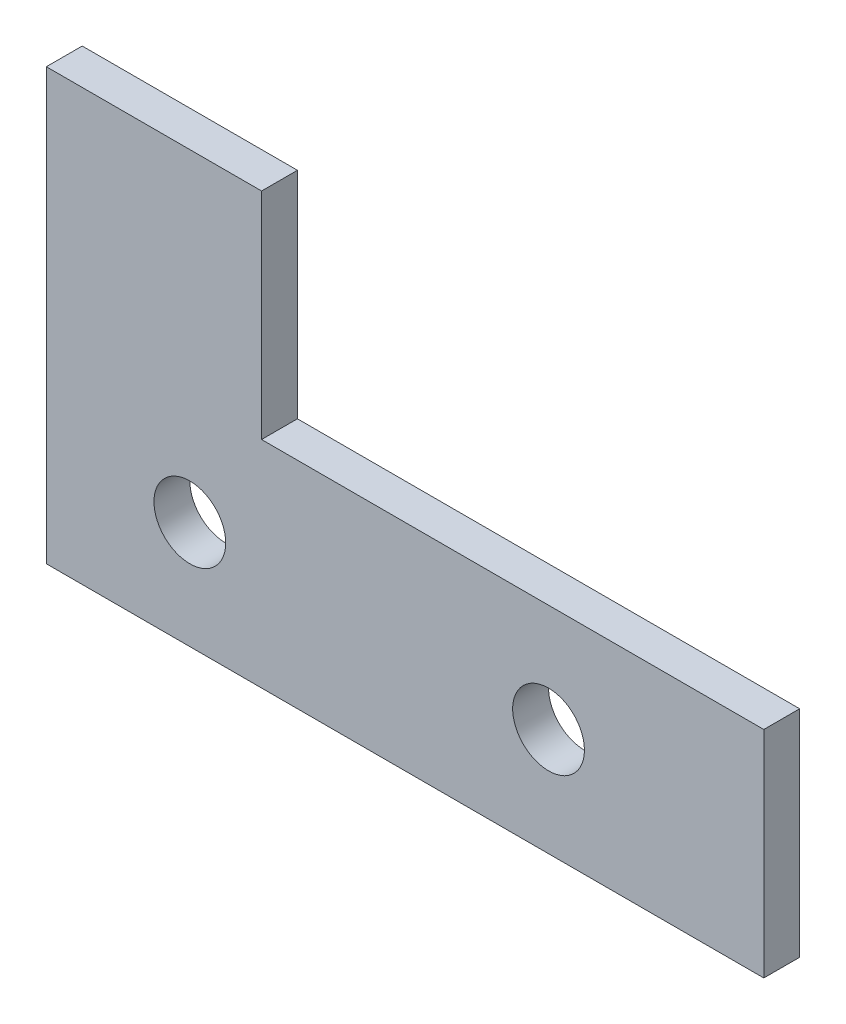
ISO-10303-21;
HEADER;
FILE_DESCRIPTION(('STEP AP214'),'2;1');
FILE_NAME('part.step','',(''),(''),'','','');
FILE_SCHEMA(('AUTOMOTIVE_DESIGN { 1 0 10303 214 1 1 1 1 }'));
ENDSEC;
DATA;
#1=APPLICATION_CONTEXT('core data for automotive mechanical design processes');
#2=APPLICATION_PROTOCOL_DEFINITION('international standard','automotive_design',2000,#1);
#3=PRODUCT_CONTEXT('',#1,'mechanical');
#4=PRODUCT('Part','Part','',(#3));
#5=PRODUCT_RELATED_PRODUCT_CATEGORY('part','',(#4));
#6=PRODUCT_DEFINITION_FORMATION('','',#4);
#7=PRODUCT_DEFINITION_CONTEXT('part definition',#1,'design');
#8=PRODUCT_DEFINITION('design','',#6,#7);
#9=PRODUCT_DEFINITION_SHAPE('','',#8);
#10=(LENGTH_UNIT() NAMED_UNIT(*) SI_UNIT(.MILLI.,.METRE.));
#11=(NAMED_UNIT(*) PLANE_ANGLE_UNIT() SI_UNIT($,.RADIAN.));
#12=(NAMED_UNIT(*) SI_UNIT($,.STERADIAN.) SOLID_ANGLE_UNIT());
#13=UNCERTAINTY_MEASURE_WITH_UNIT(LENGTH_MEASURE(1.E-05),#10,'distance_accuracy_value','');
#14=(GEOMETRIC_REPRESENTATION_CONTEXT(3) GLOBAL_UNCERTAINTY_ASSIGNED_CONTEXT((#13)) GLOBAL_UNIT_ASSIGNED_CONTEXT((#10,
#11,#12)) REPRESENTATION_CONTEXT('',''));
#15=CARTESIAN_POINT('',(0.,0.,0.));
#16=DIRECTION('',(0.,0.,1.));
#17=DIRECTION('',(1.,0.,0.));
#18=AXIS2_PLACEMENT_3D('',#15,#16,#17);
#19=CARTESIAN_POINT('',(0.,76.2,6.35));
#20=DIRECTION('',(0.,0.,-1.));
#21=DIRECTION('',(-1.,0.,0.));
#22=AXIS2_PLACEMENT_3D('',#19,#20,#21);
#23=PLANE('',#22);
#24=CARTESIAN_POINT('',(25.4,19.05,6.35));
#25=DIRECTION('',(0.,0.,1.));
#26=DIRECTION('',(1.,0.,0.));
#27=AXIS2_PLACEMENT_3D('',#24,#25,#26);
#28=CIRCLE('',#27,6.35);
#29=CARTESIAN_POINT('',(31.75,19.05,6.35));
#30=VERTEX_POINT('',#29);
#31=EDGE_CURVE('E121',#30,#30,#28,.T.);
#32=ORIENTED_EDGE('',*,*,#31,.F.);
#33=EDGE_LOOP('',(#32));
#34=FACE_BOUND('',#33,.T.);
#35=DIRECTION('',(0.,-1.,0.));
#36=VECTOR('',#35,1.);
#37=CARTESIAN_POINT('',(0.,0.,6.35));
#38=LINE('',#37,#36);
#39=CARTESIAN_POINT('',(0.,76.2,6.35));
#40=VERTEX_POINT('',#39);
#41=CARTESIAN_POINT('',(0.,0.,6.35));
#42=VERTEX_POINT('',#41);
#43=EDGE_CURVE('E128',#40,#42,#38,.T.);
#44=ORIENTED_EDGE('',*,*,#43,.T.);
#45=DIRECTION('',(1.,0.,0.));
#46=VECTOR('',#45,1.);
#47=CARTESIAN_POINT('',(0.,0.,6.35));
#48=LINE('',#47,#46);
#49=CARTESIAN_POINT('',(127.,0.,6.35));
#50=VERTEX_POINT('',#49);
#51=EDGE_CURVE('E86',#42,#50,#48,.T.);
#52=ORIENTED_EDGE('',*,*,#51,.T.);
#53=DIRECTION('',(0.,1.,0.));
#54=VECTOR('',#53,1.);
#55=CARTESIAN_POINT('',(127.,0.,6.35));
#56=LINE('',#55,#54);
#57=CARTESIAN_POINT('',(127.,38.1,6.35));
#58=VERTEX_POINT('',#57);
#59=EDGE_CURVE('E99',#50,#58,#56,.T.);
#60=ORIENTED_EDGE('',*,*,#59,.T.);
#61=DIRECTION('',(-1.,0.,0.));
#62=VECTOR('',#61,1.);
#63=CARTESIAN_POINT('',(38.1,38.1,6.35));
#64=LINE('',#63,#62);
#65=CARTESIAN_POINT('',(38.1,38.1,6.35));
#66=VERTEX_POINT('',#65);
#67=EDGE_CURVE('E93',#58,#66,#64,.T.);
#68=ORIENTED_EDGE('',*,*,#67,.T.);
#69=DIRECTION('',(0.,1.,0.));
#70=VECTOR('',#69,1.);
#71=CARTESIAN_POINT('',(38.1,38.1,6.35));
#72=LINE('',#71,#70);
#73=CARTESIAN_POINT('',(38.1,76.2,6.35));
#74=VERTEX_POINT('',#73);
#75=EDGE_CURVE('E97',#66,#74,#72,.T.);
#76=ORIENTED_EDGE('',*,*,#75,.T.);
#77=DIRECTION('',(-1.,0.,0.));
#78=VECTOR('',#77,1.);
#79=CARTESIAN_POINT('',(0.,76.2,6.35));
#80=LINE('',#79,#78);
#81=EDGE_CURVE('E49',#74,#40,#80,.T.);
#82=ORIENTED_EDGE('',*,*,#81,.T.);
#83=EDGE_LOOP('',(#44,#52,#60,#68,#76,#82));
#84=FACE_BOUND('',#83,.T.);
#85=CARTESIAN_POINT('',(88.9,19.05,6.35));
#86=DIRECTION('',(0.,0.,1.));
#87=DIRECTION('',(1.,0.,0.));
#88=AXIS2_PLACEMENT_3D('',#85,#86,#87);
#89=CIRCLE('',#88,6.35);
#90=CARTESIAN_POINT('',(95.25,19.05,6.35));
#91=VERTEX_POINT('',#90);
#92=EDGE_CURVE('E171',#91,#91,#89,.T.);
#93=ORIENTED_EDGE('',*,*,#92,.F.);
#94=EDGE_LOOP('',(#93));
#95=FACE_BOUND('',#94,.T.);
#96=ADVANCED_FACE('F32',(#34,#84,#95),#23,.F.);
#97=CARTESIAN_POINT('',(0.,76.2,0.));
#98=DIRECTION('',(0.,0.,-1.));
#99=DIRECTION('',(-1.,0.,0.));
#100=AXIS2_PLACEMENT_3D('',#97,#98,#99);
#101=PLANE('',#100);
#102=CARTESIAN_POINT('',(25.4,19.05,0.));
#103=DIRECTION('',(0.,0.,1.));
#104=DIRECTION('',(1.,0.,0.));
#105=AXIS2_PLACEMENT_3D('',#102,#103,#104);
#106=CIRCLE('',#105,6.35);
#107=CARTESIAN_POINT('',(31.75,19.05,0.));
#108=VERTEX_POINT('',#107);
#109=EDGE_CURVE('E176',#108,#108,#106,.T.);
#110=ORIENTED_EDGE('',*,*,#109,.T.);
#111=EDGE_LOOP('',(#110));
#112=FACE_BOUND('',#111,.T.);
#113=DIRECTION('',(0.,-1.,0.));
#114=VECTOR('',#113,1.);
#115=CARTESIAN_POINT('',(0.,0.,0.));
#116=LINE('',#115,#114);
#117=CARTESIAN_POINT('',(0.,76.2,0.));
#118=VERTEX_POINT('',#117);
#119=CARTESIAN_POINT('',(0.,0.,0.));
#120=VERTEX_POINT('',#119);
#121=EDGE_CURVE('E117',#118,#120,#116,.T.);
#122=ORIENTED_EDGE('',*,*,#121,.F.);
#123=DIRECTION('',(-1.,0.,0.));
#124=VECTOR('',#123,1.);
#125=CARTESIAN_POINT('',(0.,76.2,0.));
#126=LINE('',#125,#124);
#127=CARTESIAN_POINT('',(38.1,76.2,0.));
#128=VERTEX_POINT('',#127);
#129=EDGE_CURVE('E78',#128,#118,#126,.T.);
#130=ORIENTED_EDGE('',*,*,#129,.F.);
#131=DIRECTION('',(0.,1.,0.));
#132=VECTOR('',#131,1.);
#133=CARTESIAN_POINT('',(38.1,38.1,0.));
#134=LINE('',#133,#132);
#135=CARTESIAN_POINT('',(38.1,38.1,0.));
#136=VERTEX_POINT('',#135);
#137=EDGE_CURVE('E72',#136,#128,#134,.T.);
#138=ORIENTED_EDGE('',*,*,#137,.F.);
#139=DIRECTION('',(-1.,0.,0.));
#140=VECTOR('',#139,1.);
#141=CARTESIAN_POINT('',(38.1,38.1,0.));
#142=LINE('',#141,#140);
#143=CARTESIAN_POINT('',(127.,38.1,0.));
#144=VERTEX_POINT('',#143);
#145=EDGE_CURVE('E107',#144,#136,#142,.T.);
#146=ORIENTED_EDGE('',*,*,#145,.F.);
#147=DIRECTION('',(0.,1.,0.));
#148=VECTOR('',#147,1.);
#149=CARTESIAN_POINT('',(127.,0.,0.));
#150=LINE('',#149,#148);
#151=CARTESIAN_POINT('',(127.,0.,0.));
#152=VERTEX_POINT('',#151);
#153=EDGE_CURVE('E123',#152,#144,#150,.T.);
#154=ORIENTED_EDGE('',*,*,#153,.F.);
#155=DIRECTION('',(1.,0.,0.));
#156=VECTOR('',#155,1.);
#157=CARTESIAN_POINT('',(0.,0.,0.));
#158=LINE('',#157,#156);
#159=EDGE_CURVE('E120',#120,#152,#158,.T.);
#160=ORIENTED_EDGE('',*,*,#159,.F.);
#161=EDGE_LOOP('',(#122,#130,#138,#146,#154,#160));
#162=FACE_BOUND('',#161,.T.);
#163=CARTESIAN_POINT('',(88.9,19.05,0.));
#164=DIRECTION('',(0.,0.,1.));
#165=DIRECTION('',(1.,0.,0.));
#166=AXIS2_PLACEMENT_3D('',#163,#164,#165);
#167=CIRCLE('',#166,6.35);
#168=CARTESIAN_POINT('',(95.25,19.05,0.));
#169=VERTEX_POINT('',#168);
#170=EDGE_CURVE('E174',#169,#169,#167,.T.);
#171=ORIENTED_EDGE('',*,*,#170,.T.);
#172=EDGE_LOOP('',(#171));
#173=FACE_BOUND('',#172,.T.);
#174=ADVANCED_FACE('F137',(#112,#162,#173),#101,.T.);
#175=CARTESIAN_POINT('',(0.,0.,6.35));
#176=DIRECTION('',(1.,0.,0.));
#177=DIRECTION('',(0.,0.,-1.));
#178=AXIS2_PLACEMENT_3D('',#175,#176,#177);
#179=PLANE('',#178);
#180=ORIENTED_EDGE('',*,*,#121,.T.);
#181=DIRECTION('',(0.,0.,-1.));
#182=VECTOR('',#181,1.);
#183=CARTESIAN_POINT('',(0.,0.,6.35));
#184=LINE('',#183,#182);
#185=EDGE_CURVE('E11',#42,#120,#184,.T.);
#186=ORIENTED_EDGE('',*,*,#185,.F.);
#187=ORIENTED_EDGE('',*,*,#43,.F.);
#188=DIRECTION('',(0.,0.,-1.));
#189=VECTOR('',#188,1.);
#190=CARTESIAN_POINT('',(0.,76.2,6.35));
#191=LINE('',#190,#189);
#192=EDGE_CURVE('E113',#40,#118,#191,.T.);
#193=ORIENTED_EDGE('',*,*,#192,.T.);
#194=EDGE_LOOP('',(#180,#186,#187,#193));
#195=FACE_BOUND('',#194,.T.);
#196=ADVANCED_FACE('F34',(#195),#179,.F.);
#197=CARTESIAN_POINT('',(0.,0.,6.35));
#198=DIRECTION('',(0.,1.,0.));
#199=DIRECTION('',(0.,0.,1.));
#200=AXIS2_PLACEMENT_3D('',#197,#198,#199);
#201=PLANE('',#200);
#202=ORIENTED_EDGE('',*,*,#159,.T.);
#203=DIRECTION('',(0.,0.,-1.));
#204=VECTOR('',#203,1.);
#205=CARTESIAN_POINT('',(127.,0.,6.35));
#206=LINE('',#205,#204);
#207=EDGE_CURVE('E41',#50,#152,#206,.T.);
#208=ORIENTED_EDGE('',*,*,#207,.F.);
#209=ORIENTED_EDGE('',*,*,#51,.F.);
#210=ORIENTED_EDGE('',*,*,#185,.T.);
#211=EDGE_LOOP('',(#202,#208,#209,#210));
#212=FACE_BOUND('',#211,.T.);
#213=ADVANCED_FACE('F217',(#212),#201,.F.);
#214=CARTESIAN_POINT('',(127.,0.,6.35));
#215=DIRECTION('',(-1.,0.,0.));
#216=DIRECTION('',(0.,0.,1.));
#217=AXIS2_PLACEMENT_3D('',#214,#215,#216);
#218=PLANE('',#217);
#219=ORIENTED_EDGE('',*,*,#153,.T.);
#220=DIRECTION('',(0.,0.,-1.));
#221=VECTOR('',#220,1.);
#222=CARTESIAN_POINT('',(127.,38.1,6.35));
#223=LINE('',#222,#221);
#224=EDGE_CURVE('E108',#58,#144,#223,.T.);
#225=ORIENTED_EDGE('',*,*,#224,.F.);
#226=ORIENTED_EDGE('',*,*,#59,.F.);
#227=ORIENTED_EDGE('',*,*,#207,.T.);
#228=EDGE_LOOP('',(#219,#225,#226,#227));
#229=FACE_BOUND('',#228,.T.);
#230=ADVANCED_FACE('F134',(#229),#218,.F.);
#231=CARTESIAN_POINT('',(38.1,38.1,6.35));
#232=DIRECTION('',(0.,-1.,0.));
#233=DIRECTION('',(0.,0.,-1.));
#234=AXIS2_PLACEMENT_3D('',#231,#232,#233);
#235=PLANE('',#234);
#236=ORIENTED_EDGE('',*,*,#145,.T.);
#237=DIRECTION('',(0.,0.,-1.));
#238=VECTOR('',#237,1.);
#239=CARTESIAN_POINT('',(38.1,38.1,6.35));
#240=LINE('',#239,#238);
#241=EDGE_CURVE('E104',#66,#136,#240,.T.);
#242=ORIENTED_EDGE('',*,*,#241,.F.);
#243=ORIENTED_EDGE('',*,*,#67,.F.);
#244=ORIENTED_EDGE('',*,*,#224,.T.);
#245=EDGE_LOOP('',(#236,#242,#243,#244));
#246=FACE_BOUND('',#245,.T.);
#247=ADVANCED_FACE('F105',(#246),#235,.F.);
#248=CARTESIAN_POINT('',(38.1,38.1,6.35));
#249=DIRECTION('',(-1.,0.,0.));
#250=DIRECTION('',(0.,0.,1.));
#251=AXIS2_PLACEMENT_3D('',#248,#249,#250);
#252=PLANE('',#251);
#253=ORIENTED_EDGE('',*,*,#137,.T.);
#254=DIRECTION('',(0.,0.,-1.));
#255=VECTOR('',#254,1.);
#256=CARTESIAN_POINT('',(38.1,76.2,6.35));
#257=LINE('',#256,#255);
#258=EDGE_CURVE('E109',#74,#128,#257,.T.);
#259=ORIENTED_EDGE('',*,*,#258,.F.);
#260=ORIENTED_EDGE('',*,*,#75,.F.);
#261=ORIENTED_EDGE('',*,*,#241,.T.);
#262=EDGE_LOOP('',(#253,#259,#260,#261));
#263=FACE_BOUND('',#262,.T.);
#264=ADVANCED_FACE('F111',(#263),#252,.F.);
#265=CARTESIAN_POINT('',(0.,76.2,6.35));
#266=DIRECTION('',(0.,-1.,0.));
#267=DIRECTION('',(0.,0.,-1.));
#268=AXIS2_PLACEMENT_3D('',#265,#266,#267);
#269=PLANE('',#268);
#270=ORIENTED_EDGE('',*,*,#129,.T.);
#271=ORIENTED_EDGE('',*,*,#192,.F.);
#272=ORIENTED_EDGE('',*,*,#81,.F.);
#273=ORIENTED_EDGE('',*,*,#258,.T.);
#274=EDGE_LOOP('',(#270,#271,#272,#273));
#275=FACE_BOUND('',#274,.T.);
#276=ADVANCED_FACE('F142',(#275),#269,.F.);
#277=CARTESIAN_POINT('',(25.4,19.05,6.35));
#278=DIRECTION('',(0.,0.,-1.));
#279=DIRECTION('',(-1.,0.,0.));
#280=AXIS2_PLACEMENT_3D('',#277,#278,#279);
#281=CYLINDRICAL_SURFACE('',#280,6.35);
#282=ORIENTED_EDGE('',*,*,#31,.T.);
#283=EDGE_LOOP('',(#282));
#284=FACE_BOUND('',#283,.T.);
#285=ORIENTED_EDGE('',*,*,#109,.F.);
#286=EDGE_LOOP('',(#285));
#287=FACE_BOUND('',#286,.T.);
#288=ADVANCED_FACE('F144',(#284,#287),#281,.F.);
#289=CARTESIAN_POINT('',(88.9,19.05,6.35));
#290=DIRECTION('',(0.,0.,-1.));
#291=DIRECTION('',(-1.,0.,0.));
#292=AXIS2_PLACEMENT_3D('',#289,#290,#291);
#293=CYLINDRICAL_SURFACE('',#292,6.35);
#294=ORIENTED_EDGE('',*,*,#92,.T.);
#295=EDGE_LOOP('',(#294));
#296=FACE_BOUND('',#295,.T.);
#297=ORIENTED_EDGE('',*,*,#170,.F.);
#298=EDGE_LOOP('',(#297));
#299=FACE_BOUND('',#298,.T.);
#300=ADVANCED_FACE('F150',(#296,#299),#293,.F.);
#301=CLOSED_SHELL('',(#96,#174,#196,#213,#230,#247,#264,#276,#288,#300));
#302=MANIFOLD_SOLID_BREP('B2',#301);
#303=ADVANCED_BREP_SHAPE_REPRESENTATION('',(#18,#302),#14);
#304=SHAPE_DEFINITION_REPRESENTATION(#9,#303);
ENDSEC;
END-ISO-10303-21;
